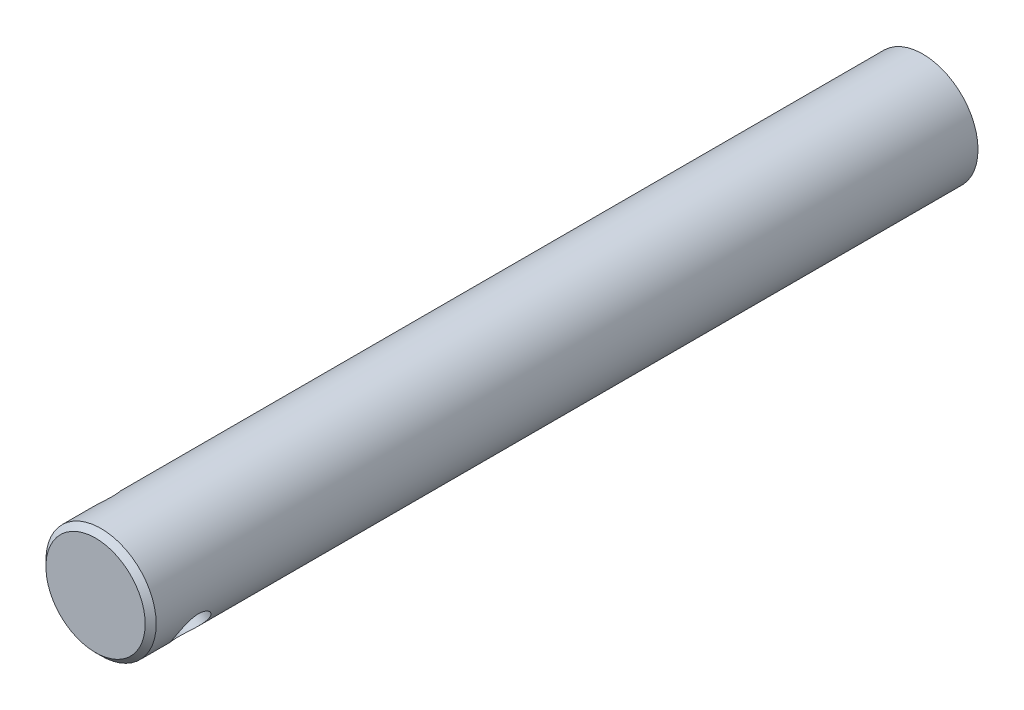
ISO-10303-21;
HEADER;
FILE_DESCRIPTION(('STEP AP214'),'2;1');
FILE_NAME('part.step','',(''),(''),'','','');
FILE_SCHEMA(('AUTOMOTIVE_DESIGN { 1 0 10303 214 1 1 1 1 }'));
ENDSEC;
DATA;
#1=APPLICATION_CONTEXT('core data for automotive mechanical design processes');
#2=APPLICATION_PROTOCOL_DEFINITION('international standard','automotive_design',2000,#1);
#3=PRODUCT_CONTEXT('',#1,'mechanical');
#4=PRODUCT('Part','Part','',(#3));
#5=PRODUCT_RELATED_PRODUCT_CATEGORY('part','',(#4));
#6=PRODUCT_DEFINITION_FORMATION('','',#4);
#7=PRODUCT_DEFINITION_CONTEXT('part definition',#1,'design');
#8=PRODUCT_DEFINITION('design','',#6,#7);
#9=PRODUCT_DEFINITION_SHAPE('','',#8);
#10=(LENGTH_UNIT() NAMED_UNIT(*) SI_UNIT(.MILLI.,.METRE.));
#11=(NAMED_UNIT(*) PLANE_ANGLE_UNIT() SI_UNIT($,.RADIAN.));
#12=(NAMED_UNIT(*) SI_UNIT($,.STERADIAN.) SOLID_ANGLE_UNIT());
#13=UNCERTAINTY_MEASURE_WITH_UNIT(LENGTH_MEASURE(1.E-05),#10,'distance_accuracy_value','');
#14=(GEOMETRIC_REPRESENTATION_CONTEXT(3) GLOBAL_UNCERTAINTY_ASSIGNED_CONTEXT((#13)) GLOBAL_UNIT_ASSIGNED_CONTEXT((#10,
#11,#12)) REPRESENTATION_CONTEXT('',''));
#15=CARTESIAN_POINT('',(0.,0.,0.));
#16=DIRECTION('',(0.,0.,1.));
#17=DIRECTION('',(1.,0.,0.));
#18=AXIS2_PLACEMENT_3D('',#15,#16,#17);
#19=CARTESIAN_POINT('',(0.,0.,150.));
#20=DIRECTION('',(0.,0.,-1.));
#21=DIRECTION('',(-1.,0.,0.));
#22=AXIS2_PLACEMENT_3D('',#19,#20,#21);
#23=CYLINDRICAL_SURFACE('',#22,10.);
#24=CARTESIAN_POINT('',(0.,0.,149.));
#25=DIRECTION('',(0.,0.,1.));
#26=DIRECTION('',(1.,0.,0.));
#27=AXIS2_PLACEMENT_3D('',#24,#25,#26);
#28=CIRCLE('',#27,10.);
#29=CARTESIAN_POINT('',(10.,0.,149.));
#30=VERTEX_POINT('',#29);
#31=EDGE_CURVE('E10',#30,#30,#28,.F.);
#32=ORIENTED_EDGE('',*,*,#31,.T.);
#33=EDGE_LOOP('',(#32));
#34=FACE_BOUND('',#33,.T.);
#35=CARTESIAN_POINT('',(6.04702326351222,-7.96451565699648,141.));
#36=CARTESIAN_POINT('',(6.04702341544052,-7.96451571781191,141.177299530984));
#37=CARTESIAN_POINT('',(6.05931454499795,-7.95522824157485,141.354601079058));
#38=CARTESIAN_POINT('',(6.10762834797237,-7.91819295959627,141.703969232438));
#39=CARTESIAN_POINT('',(6.14365592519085,-7.89044133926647,141.876034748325));
#40=CARTESIAN_POINT('',(6.23701537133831,-7.81684927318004,142.209816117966));
#41=CARTESIAN_POINT('',(6.29430714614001,-7.77104286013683,142.37155078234));
#42=CARTESIAN_POINT('',(6.42690933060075,-7.66173561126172,142.68103928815));
#43=CARTESIAN_POINT('',(6.50222340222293,-7.59823117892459,142.828790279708));
#44=CARTESIAN_POINT('',(6.66986819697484,-7.45155335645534,143.11161020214));
#45=CARTESIAN_POINT('',(6.76268725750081,-7.36778871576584,143.246083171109));
#46=CARTESIAN_POINT('',(6.95912697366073,-7.18253135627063,143.493188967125));
#47=CARTESIAN_POINT('',(7.06274926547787,-7.08103595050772,143.605818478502));
#48=CARTESIAN_POINT('',(7.27892430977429,-6.85870620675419,143.808714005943));
#49=CARTESIAN_POINT('',(7.39163428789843,-6.73745663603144,143.89835993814));
#50=CARTESIAN_POINT('',(7.61873753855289,-6.47953007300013,144.048648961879));
#51=CARTESIAN_POINT('',(7.73313037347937,-6.34285703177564,144.109299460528));
#52=CARTESIAN_POINT('',(7.95509891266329,-6.06196053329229,144.197867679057));
#53=CARTESIAN_POINT('',(8.06277485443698,-5.91813845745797,144.226805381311));
#54=CARTESIAN_POINT('',(8.27136751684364,-5.62290971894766,144.254365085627));
#55=CARTESIAN_POINT('',(8.3722858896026,-5.47150492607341,144.252994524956));
#56=CARTESIAN_POINT('',(8.56069504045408,-5.1715303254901,144.220633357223));
#57=CARTESIAN_POINT('',(8.64854630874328,-5.02306548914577,144.190749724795));
#58=CARTESIAN_POINT('',(8.81333107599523,-4.72797743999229,144.104035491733));
#59=CARTESIAN_POINT('',(8.89026384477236,-4.58135435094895,144.047203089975));
#60=CARTESIAN_POINT('',(9.03325413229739,-4.29262492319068,143.9075321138));
#61=CARTESIAN_POINT('',(9.09915989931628,-4.15060038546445,143.824370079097));
#62=CARTESIAN_POINT('',(9.21886349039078,-3.87747653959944,143.634664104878));
#63=CARTESIAN_POINT('',(9.2726580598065,-3.74638017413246,143.528113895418));
#64=CARTESIAN_POINT('',(9.37085689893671,-3.49374323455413,143.289034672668));
#65=CARTESIAN_POINT('',(9.41473122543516,-3.37289580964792,143.155554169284));
#66=CARTESIAN_POINT('',(9.49090749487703,-3.15219611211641,142.869282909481));
#67=CARTESIAN_POINT('',(9.52320783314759,-3.05234675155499,142.716489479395));
#68=CARTESIAN_POINT('',(9.57773292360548,-2.87673956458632,142.39329252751));
#69=CARTESIAN_POINT('',(9.59982167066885,-2.80131073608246,142.222686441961));
#70=CARTESIAN_POINT('',(9.63434410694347,-2.68019150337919,141.870315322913));
#71=CARTESIAN_POINT('',(9.64678160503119,-2.63448936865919,141.688554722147));
#72=CARTESIAN_POINT('',(9.66237537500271,-2.57669647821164,141.327432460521));
#73=CARTESIAN_POINT('',(9.66590876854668,-2.56324122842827,141.148305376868));
#74=CARTESIAN_POINT('',(9.6649923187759,-2.56669670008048,140.79038369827));
#75=CARTESIAN_POINT('',(9.66054383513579,-2.58360224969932,140.61158905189));
#76=CARTESIAN_POINT('',(9.64369209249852,-2.64578382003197,140.265384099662));
#77=CARTESIAN_POINT('',(9.6315487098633,-2.69013192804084,140.097792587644));
#78=CARTESIAN_POINT('',(9.59896507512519,-2.80416871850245,139.772331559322));
#79=CARTESIAN_POINT('',(9.57852339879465,-2.87386175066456,139.614463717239));
#80=CARTESIAN_POINT('',(9.52774176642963,-3.0380445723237,139.307596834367));
#81=CARTESIAN_POINT('',(9.4971188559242,-3.13322600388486,139.159015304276));
#82=CARTESIAN_POINT('',(9.42513437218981,-3.3435272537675,138.87960276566));
#83=CARTESIAN_POINT('',(9.38376978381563,-3.45865266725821,138.748776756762));
#84=CARTESIAN_POINT('',(9.28718858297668,-3.71040210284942,138.502459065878));
#85=CARTESIAN_POINT('',(9.23142866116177,-3.84776452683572,138.387932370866));
#86=CARTESIAN_POINT('',(9.10639689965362,-4.13497646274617,138.184809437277));
#87=CARTESIAN_POINT('',(9.03712560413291,-4.28482547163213,138.096212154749));
#88=CARTESIAN_POINT('',(8.88561583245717,-4.5907219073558,137.948293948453));
#89=CARTESIAN_POINT('',(8.80347159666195,-4.74671855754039,137.888772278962));
#90=CARTESIAN_POINT('',(8.62695351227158,-5.06043600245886,137.800283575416));
#91=CARTESIAN_POINT('',(8.53258384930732,-5.21815619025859,137.771306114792));
#92=CARTESIAN_POINT('',(8.33837404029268,-5.52292599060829,137.745630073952));
#93=CARTESIAN_POINT('',(8.23896871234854,-5.67013701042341,137.747542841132));
#94=CARTESIAN_POINT('',(8.03407207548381,-5.95690661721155,137.780194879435));
#95=CARTESIAN_POINT('',(7.92858122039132,-6.09646577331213,137.810932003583));
#96=CARTESIAN_POINT('',(7.71672495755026,-6.36244267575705,137.899453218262));
#97=CARTESIAN_POINT('',(7.61039427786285,-6.48902132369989,137.956839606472));
#98=CARTESIAN_POINT('',(7.39920009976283,-6.72884827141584,138.096666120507));
#99=CARTESIAN_POINT('',(7.29433686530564,-6.84209419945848,138.179110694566));
#100=CARTESIAN_POINT('',(7.08636072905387,-7.05738656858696,138.370114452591));
#101=CARTESIAN_POINT('',(6.98344458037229,-7.15888756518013,138.479502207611));
#102=CARTESIAN_POINT('',(6.78774273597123,-7.34471198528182,138.719856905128));
#103=CARTESIAN_POINT('',(6.69496020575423,-7.42903004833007,138.850830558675));
#104=CARTESIAN_POINT('',(6.52066666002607,-7.58253968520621,139.136387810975));
#105=CARTESIAN_POINT('',(6.43969374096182,-7.65106318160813,139.291661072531));
#106=CARTESIAN_POINT('',(6.29779870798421,-7.76828460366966,139.618040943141));
#107=CARTESIAN_POINT('',(6.23687015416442,-7.81698889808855,139.789142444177));
#108=CARTESIAN_POINT('',(6.14196788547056,-7.89174692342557,140.131542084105));
#109=CARTESIAN_POINT('',(6.10656591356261,-7.91901029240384,140.302179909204));
#110=CARTESIAN_POINT('',(6.05909704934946,-7.95539189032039,140.648545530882));
#111=CARTESIAN_POINT('',(6.04702311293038,-7.96451559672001,140.824271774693));
#112=CARTESIAN_POINT('',(6.04702326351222,-7.96451565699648,141.));
#113=B_SPLINE_CURVE_WITH_KNOTS('',3,(#35,#36,#37,#38,#39,#40,#41,#42,#43,#44,#45,#46,#47,#48,
#49,#50,#51,#52,#53,#54,#55,#56,#57,#58,#59,#60,#61,#62,#63,#64,#65,#66,#67,#68,#69,#70,#71,#72,
#73,#74,#75,#76,#77,#78,#79,#80,#81,#82,#83,#84,#85,#86,#87,#88,#89,#90,#91,#92,#93,#94,#95,#96,
#97,#98,#99,#100,#101,#102,#103,#104,#105,#106,#107,#108,#109,#110,#111,#112),.UNSPECIFIED.,.T.,
.F.,(4,2,2,2,2,2,2,2,2,2,2,2,2,2,2,2,2,2,2,2,2,2,2,2,2,2,2,2,2,2,2,2,2,2,2,2,2,2,4),(0.,
0.531248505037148,1.06260679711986,1.59296824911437,2.12343755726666,2.67180188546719,
3.22024938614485,3.7822237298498,4.34405443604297,4.88723029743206,5.43027287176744,
5.95305557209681,6.47587321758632,7.00538064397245,7.53503019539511,8.08845610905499,
8.64195872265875,9.20263474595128,9.76308938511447,10.2993744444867,10.8355681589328,
11.3545536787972,11.8736283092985,12.4085390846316,12.9436001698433,13.5029364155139,
14.0622501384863,14.6176456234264,15.1728514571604,15.7031706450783,16.2334503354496,
16.7560588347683,17.278760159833,17.8201569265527,18.3617223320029,18.9231471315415,
19.4843913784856,20.0110907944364,20.5376311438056),.UNSPECIFIED.);
#114=CARTESIAN_POINT('',(6.04702326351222,-7.96451565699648,141.));
#115=VERTEX_POINT('',#114);
#116=EDGE_CURVE('E54',#115,#115,#113,.T.);
#117=ORIENTED_EDGE('',*,*,#116,.T.);
#118=EDGE_LOOP('',(#117));
#119=FACE_BOUND('',#118,.T.);
#120=CARTESIAN_POINT('',(-9.66548975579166,2.56482119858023,141.));
#121=CARTESIAN_POINT('',(-9.66548986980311,2.56482131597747,140.822700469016));
#122=CARTESIAN_POINT('',(-9.66157291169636,2.57972052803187,140.645398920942));
#123=CARTESIAN_POINT('',(-9.6456876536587,2.63848696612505,140.296030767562));
#124=CARTESIAN_POINT('',(-9.63371769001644,2.68236017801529,140.123965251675));
#125=CARTESIAN_POINT('',(-9.6011471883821,2.79668839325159,139.790183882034));
#126=CARTESIAN_POINT('',(-9.58056288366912,2.86709337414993,139.62844921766));
#127=CARTESIAN_POINT('',(-9.52987928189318,3.03129625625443,139.31896071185));
#128=CARTESIAN_POINT('',(-9.49977805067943,3.12509891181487,139.171209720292));
#129=CARTESIAN_POINT('',(-9.42785338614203,3.33592111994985,138.88838979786));
#130=CARTESIAN_POINT('',(-9.38566876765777,3.45361713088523,138.753916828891));
#131=CARTESIAN_POINT('',(-9.28900950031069,3.70573979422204,138.506811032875));
#132=CARTESIAN_POINT('',(-9.23453298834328,3.84016898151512,138.394181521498));
#133=CARTESIAN_POINT('',(-9.11108864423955,4.12463982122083,138.191285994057));
#134=CARTESIAN_POINT('',(-9.04179653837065,4.27498476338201,138.10164006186));
#135=CARTESIAN_POINT('',(-8.88958341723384,4.58309702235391,137.951351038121));
#136=CARTESIAN_POINT('',(-8.80666588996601,4.74086243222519,137.890700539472));
#137=CARTESIAN_POINT('',(-8.63125555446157,5.05295871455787,137.802132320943));
#138=CARTESIAN_POINT('',(-8.53917209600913,5.20722969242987,137.773194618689));
#139=CARTESIAN_POINT('',(-8.34542031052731,5.51240366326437,137.745634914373));
#140=CARTESIAN_POINT('',(-8.24375434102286,5.66330747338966,137.747005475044));
#141=CARTESIAN_POINT('',(-8.03793933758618,5.95161798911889,137.779366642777));
#142=CARTESIAN_POINT('',(-7.93402445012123,6.08931820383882,137.809250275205));
#143=CARTESIAN_POINT('',(-7.72374707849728,6.35392055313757,137.895964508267));
#144=CARTESIAN_POINT('',(-7.61738443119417,6.48082196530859,137.952796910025));
#145=CARTESIAN_POINT('',(-7.40470194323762,6.72284895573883,138.092467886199));
#146=CARTESIAN_POINT('',(-7.29840006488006,6.83780307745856,138.175629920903));
#147=CARTESIAN_POINT('',(-7.09129767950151,7.05235886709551,138.365335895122));
#148=CARTESIAN_POINT('',(-6.99049865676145,7.15195640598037,138.471886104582));
#149=CARTESIAN_POINT('',(-6.79416862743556,7.3388332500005,138.710965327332));
#150=CARTESIAN_POINT('',(-6.69907723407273,7.4253588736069,138.844445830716));
#151=CARTESIAN_POINT('',(-6.52391315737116,7.57972443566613,139.130717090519));
#152=CARTESIAN_POINT('',(-6.44384255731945,7.6475617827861,139.283510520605));
#153=CARTESIAN_POINT('',(-6.30215300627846,7.76475794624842,139.60670747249));
#154=CARTESIAN_POINT('',(-6.24078663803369,7.81386588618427,139.777313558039));
#155=CARTESIAN_POINT('',(-6.14188827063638,7.89184524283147,140.129684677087));
#156=CARTESIAN_POINT('',(-6.10434686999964,7.92072464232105,140.311445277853));
#157=CARTESIAN_POINT('',(-6.05682268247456,7.9571201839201,140.672567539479));
#158=CARTESIAN_POINT('',(-6.04572124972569,7.96550390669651,140.851694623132));
#159=CARTESIAN_POINT('',(-6.04856879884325,7.96334251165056,141.20961630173));
#160=CARTESIAN_POINT('',(-6.06251351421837,7.95280061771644,141.38841094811));
#161=CARTESIAN_POINT('',(-6.11361853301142,7.91357300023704,141.734615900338));
#162=CARTESIAN_POINT('',(-6.15001941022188,7.88548042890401,141.902207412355));
#163=CARTESIAN_POINT('',(-6.2431043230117,7.81198701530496,142.227668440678));
#164=CARTESIAN_POINT('',(-6.29979184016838,7.76658320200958,142.385536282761));
#165=CARTESIAN_POINT('',(-6.43233819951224,7.6571929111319,142.692403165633));
#166=CARTESIAN_POINT('',(-6.50872916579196,7.59268176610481,142.840984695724));
#167=CARTESIAN_POINT('',(-6.67586938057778,7.44614668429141,143.12039723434));
#168=CARTESIAN_POINT('',(-6.76662265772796,7.36411783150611,143.251223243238));
#169=CARTESIAN_POINT('',(-6.96274685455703,7.17907457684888,143.497540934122));
#170=CARTESIAN_POINT('',(-7.06859416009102,7.07527692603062,143.612067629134));
#171=CARTESIAN_POINT('',(-7.28670092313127,6.85043681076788,143.815190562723));
#172=CARTESIAN_POINT('',(-7.39896012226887,6.72939504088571,143.903787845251));
#173=CARTESIAN_POINT('',(-7.62428136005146,6.4729614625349,144.051706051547));
#174=CARTESIAN_POINT('',(-7.73733226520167,6.33767612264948,144.111227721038));
#175=CARTESIAN_POINT('',(-7.96037906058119,6.05513869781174,144.199716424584));
#176=CARTESIAN_POINT('',(-8.07037598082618,5.90789071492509,144.228693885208));
#177=CARTESIAN_POINT('',(-8.2784206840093,5.61239201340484,144.254369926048));
#178=CARTESIAN_POINT('',(-8.37678307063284,5.46448209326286,144.252457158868));
#179=CARTESIAN_POINT('',(-8.56411618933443,5.16594274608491,144.219805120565));
#180=CARTESIAN_POINT('',(-8.65308762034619,5.01531352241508,144.189067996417));
#181=CARTESIAN_POINT('',(-8.81854342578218,4.71824254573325,144.100546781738));
#182=CARTESIAN_POINT('',(-8.89518982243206,4.57177173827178,144.043160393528));
#183=CARTESIAN_POINT('',(-9.03671113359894,4.28525530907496,143.903333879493));
#184=CARTESIAN_POINT('',(-9.10158395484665,4.14521083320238,143.820889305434));
#185=CARTESIAN_POINT('',(-9.22163661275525,3.87099880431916,143.629885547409));
#186=CARTESIAN_POINT('',(-9.27638677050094,3.73722060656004,143.520497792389));
#187=CARTESIAN_POINT('',(-9.37385105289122,3.48556480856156,143.280143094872));
#188=CARTESIAN_POINT('',(-9.41656142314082,3.36769217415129,143.149169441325));
#189=CARTESIAN_POINT('',(-9.49227701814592,3.14812305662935,142.863612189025));
#190=CARTESIAN_POINT('',(-9.52486891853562,3.04717826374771,142.708338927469));
#191=CARTESIAN_POINT('',(-9.57933924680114,2.87137142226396,142.381959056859));
#192=CARTESIAN_POINT('',(-9.60122111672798,2.7965009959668,142.210857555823));
#193=CARTESIAN_POINT('',(-9.6342834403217,2.68030252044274,141.868457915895));
#194=CARTESIAN_POINT('',(-9.64603967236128,2.63719356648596,141.697820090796));
#195=CARTESIAN_POINT('',(-9.66164157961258,2.57945714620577,141.351454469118));
#196=CARTESIAN_POINT('',(-9.66548964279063,2.5648210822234,141.175728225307));
#197=CARTESIAN_POINT('',(-9.66548975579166,2.56482119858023,141.));
#198=B_SPLINE_CURVE_WITH_KNOTS('',3,(#120,#121,#122,#123,#124,#125,#126,#127,#128,#129,#130,
#131,#132,#133,#134,#135,#136,#137,#138,#139,#140,#141,#142,#143,#144,#145,#146,#147,#148,#149,
#150,#151,#152,#153,#154,#155,#156,#157,#158,#159,#160,#161,#162,#163,#164,#165,#166,#167,#168,
#169,#170,#171,#172,#173,#174,#175,#176,#177,#178,#179,#180,#181,#182,#183,#184,#185,#186,#187,
#188,#189,#190,#191,#192,#193,#194,#195,#196,#197),.UNSPECIFIED.,.T.,.F.,(4,2,2,2,2,2,2,2,2,2,2,
2,2,2,2,2,2,2,2,2,2,2,2,2,2,2,2,2,2,2,2,2,2,2,2,2,2,2,4),(0.,0.531248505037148,1.06260679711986,
1.59296824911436,2.12343755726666,2.67180188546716,3.22024938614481,3.78222372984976,
4.34405443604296,4.88723029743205,5.43027287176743,5.9530555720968,6.47587321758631,
7.00538064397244,7.53503019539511,8.08845610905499,8.64195872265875,9.20263474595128,
9.76308938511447,10.2993744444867,10.8355681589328,11.3545536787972,11.8736283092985,
12.4085390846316,12.9436001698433,13.5029364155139,14.0622501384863,14.6176456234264,
15.1728514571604,15.7031706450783,16.2334503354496,16.7560588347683,17.278760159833,
17.8201569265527,18.3617223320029,18.9231471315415,19.4843913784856,20.0110907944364,
20.5376311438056),.UNSPECIFIED.);
#199=CARTESIAN_POINT('',(-9.66548975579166,2.56482119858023,141.));
#200=VERTEX_POINT('',#199);
#201=EDGE_CURVE('E65',#200,#200,#198,.T.);
#202=ORIENTED_EDGE('',*,*,#201,.T.);
#203=EDGE_LOOP('',(#202));
#204=FACE_BOUND('',#203,.T.);
#205=CARTESIAN_POINT('',(0.,0.,0.));
#206=DIRECTION('',(0.,0.,1.));
#207=DIRECTION('',(1.,0.,0.));
#208=AXIS2_PLACEMENT_3D('',#205,#206,#207);
#209=CIRCLE('',#208,10.);
#210=CARTESIAN_POINT('',(10.,0.,0.));
#211=VERTEX_POINT('',#210);
#212=EDGE_CURVE('E51',#211,#211,#209,.T.);
#213=ORIENTED_EDGE('',*,*,#212,.T.);
#214=EDGE_LOOP('',(#213));
#215=FACE_BOUND('',#214,.T.);
#216=ADVANCED_FACE('F39',(#34,#119,#204,#215),#23,.T.);
#217=CARTESIAN_POINT('',(0.,0.,150.));
#218=DIRECTION('',(0.,0.,1.));
#219=DIRECTION('',(1.,0.,0.));
#220=AXIS2_PLACEMENT_3D('',#217,#218,#219);
#221=PLANE('',#220);
#222=CARTESIAN_POINT('',(0.,0.,150.));
#223=DIRECTION('',(0.,0.,1.));
#224=DIRECTION('',(1.,0.,0.));
#225=AXIS2_PLACEMENT_3D('',#222,#223,#224);
#226=CIRCLE('',#225,8.99999999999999);
#227=CARTESIAN_POINT('',(8.99999999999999,0.,150.));
#228=VERTEX_POINT('',#227);
#229=EDGE_CURVE('E50',#228,#228,#226,.T.);
#230=ORIENTED_EDGE('',*,*,#229,.T.);
#231=EDGE_LOOP('',(#230));
#232=FACE_BOUND('',#231,.T.);
#233=ADVANCED_FACE('F78',(#232),#221,.T.);
#234=CARTESIAN_POINT('',(0.,0.,0.));
#235=DIRECTION('',(0.,0.,1.));
#236=DIRECTION('',(1.,0.,0.));
#237=AXIS2_PLACEMENT_3D('',#234,#235,#236);
#238=PLANE('',#237);
#239=ORIENTED_EDGE('',*,*,#212,.F.);
#240=EDGE_LOOP('',(#239));
#241=FACE_BOUND('',#240,.T.);
#242=ADVANCED_FACE('F74',(#241),#238,.F.);
#243=CARTESIAN_POINT('',(11.5255180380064,-7.72352975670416,141.));
#244=DIRECTION('',(-0.830722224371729,0.556687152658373,0.));
#245=DIRECTION('',(-0.556687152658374,-0.830722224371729,0.));
#246=AXIS2_PLACEMENT_3D('',#243,#244,#245);
#247=CYLINDRICAL_SURFACE('',#246,3.25000000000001);
#248=ORIENTED_EDGE('',*,*,#201,.F.);
#249=EDGE_LOOP('',(#248));
#250=FACE_BOUND('',#249,.T.);
#251=ORIENTED_EDGE('',*,*,#116,.F.);
#252=EDGE_LOOP('',(#251));
#253=FACE_BOUND('',#252,.T.);
#254=ADVANCED_FACE('F70',(#250,#253),#247,.F.);
#255=CARTESIAN_POINT('',(0.,0.,150.));
#256=DIRECTION('',(0.,0.,-1.));
#257=DIRECTION('',(-1.,0.,0.));
#258=AXIS2_PLACEMENT_3D('',#255,#256,#257);
#259=CONICAL_SURFACE('',#258,8.99999999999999,0.785398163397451);
#260=ORIENTED_EDGE('',*,*,#31,.F.);
#261=EDGE_LOOP('',(#260));
#262=FACE_BOUND('',#261,.T.);
#263=ORIENTED_EDGE('',*,*,#229,.F.);
#264=EDGE_LOOP('',(#263));
#265=FACE_BOUND('',#264,.T.);
#266=ADVANCED_FACE('F45',(#262,#265),#259,.T.);
#267=CLOSED_SHELL('',(#216,#233,#242,#254,#266));
#268=MANIFOLD_SOLID_BREP('B2',#267);
#269=ADVANCED_BREP_SHAPE_REPRESENTATION('',(#18,#268),#14);
#270=SHAPE_DEFINITION_REPRESENTATION(#9,#269);
ENDSEC;
END-ISO-10303-21;
